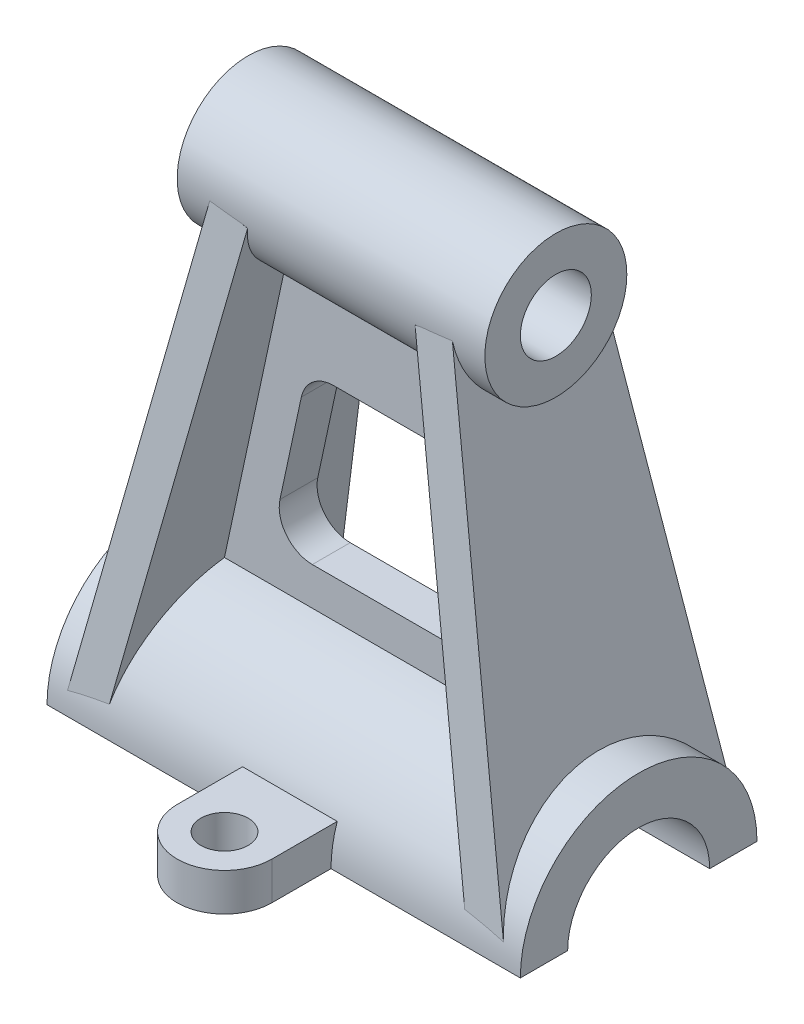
ISO-10303-21;
HEADER;
FILE_DESCRIPTION(('STEP AP214'),'2;1');
FILE_NAME('part.step','',(''),(''),'','','');
FILE_SCHEMA(('AUTOMOTIVE_DESIGN { 1 0 10303 214 1 1 1 1 }'));
ENDSEC;
DATA;
#1=APPLICATION_CONTEXT('core data for automotive mechanical design processes');
#2=APPLICATION_PROTOCOL_DEFINITION('international standard','automotive_design',2000,#1);
#3=PRODUCT_CONTEXT('',#1,'mechanical');
#4=PRODUCT('Part','Part','',(#3));
#5=PRODUCT_RELATED_PRODUCT_CATEGORY('part','',(#4));
#6=PRODUCT_DEFINITION_FORMATION('','',#4);
#7=PRODUCT_DEFINITION_CONTEXT('part definition',#1,'design');
#8=PRODUCT_DEFINITION('design','',#6,#7);
#9=PRODUCT_DEFINITION_SHAPE('','',#8);
#10=(LENGTH_UNIT() NAMED_UNIT(*) SI_UNIT(.MILLI.,.METRE.));
#11=(NAMED_UNIT(*) PLANE_ANGLE_UNIT() SI_UNIT($,.RADIAN.));
#12=(NAMED_UNIT(*) SI_UNIT($,.STERADIAN.) SOLID_ANGLE_UNIT());
#13=UNCERTAINTY_MEASURE_WITH_UNIT(LENGTH_MEASURE(1.E-05),#10,'distance_accuracy_value','');
#14=(GEOMETRIC_REPRESENTATION_CONTEXT(3) GLOBAL_UNCERTAINTY_ASSIGNED_CONTEXT((#13)) GLOBAL_UNIT_ASSIGNED_CONTEXT((#10,
#11,#12)) REPRESENTATION_CONTEXT('',''));
#15=CARTESIAN_POINT('',(0.,0.,0.));
#16=DIRECTION('',(0.,0.,1.));
#17=DIRECTION('',(1.,0.,0.));
#18=AXIS2_PLACEMENT_3D('',#15,#16,#17);
#19=CARTESIAN_POINT('',(50.,0.,25.));
#20=DIRECTION('',(0.,1.,0.));
#21=DIRECTION('',(0.,0.,1.));
#22=AXIS2_PLACEMENT_3D('',#19,#20,#21);
#23=PLANE('',#22);
#24=CARTESIAN_POINT('',(0.,0.,37.5));
#25=DIRECTION('',(0.,1.,0.));
#26=DIRECTION('',(0.,0.,1.));
#27=AXIS2_PLACEMENT_3D('',#24,#25,#26);
#28=CIRCLE('',#27,5.);
#29=CARTESIAN_POINT('',(0.,0.,42.5));
#30=VERTEX_POINT('',#29);
#31=EDGE_CURVE('E360',#30,#30,#28,.T.);
#32=ORIENTED_EDGE('',*,*,#31,.T.);
#33=EDGE_LOOP('',(#32));
#34=FACE_BOUND('',#33,.T.);
#35=DIRECTION('',(0.,0.,-1.));
#36=VECTOR('',#35,1.);
#37=CARTESIAN_POINT('',(-50.,0.,25.));
#38=LINE('',#37,#36);
#39=CARTESIAN_POINT('',(-50.,0.,25.));
#40=VERTEX_POINT('',#39);
#41=CARTESIAN_POINT('',(-50.,0.,15.));
#42=VERTEX_POINT('',#41);
#43=EDGE_CURVE('E261',#40,#42,#38,.T.);
#44=ORIENTED_EDGE('',*,*,#43,.T.);
#45=DIRECTION('',(1.,0.,0.));
#46=VECTOR('',#45,1.);
#47=CARTESIAN_POINT('',(-50.,0.,15.));
#48=LINE('',#47,#46);
#49=CARTESIAN_POINT('',(50.,0.,15.));
#50=VERTEX_POINT('',#49);
#51=EDGE_CURVE('E48',#42,#50,#48,.T.);
#52=ORIENTED_EDGE('',*,*,#51,.T.);
#53=DIRECTION('',(0.,0.,-1.));
#54=VECTOR('',#53,1.);
#55=CARTESIAN_POINT('',(50.,0.,25.));
#56=LINE('',#55,#54);
#57=CARTESIAN_POINT('',(50.,0.,25.));
#58=VERTEX_POINT('',#57);
#59=EDGE_CURVE('E271',#58,#50,#56,.T.);
#60=ORIENTED_EDGE('',*,*,#59,.F.);
#61=DIRECTION('',(-1.,0.,0.));
#62=VECTOR('',#61,1.);
#63=CARTESIAN_POINT('',(50.,0.,25.));
#64=LINE('',#63,#62);
#65=CARTESIAN_POINT('',(10.,0.,25.));
#66=VERTEX_POINT('',#65);
#67=EDGE_CURVE('E272',#58,#66,#64,.T.);
#68=ORIENTED_EDGE('',*,*,#67,.T.);
#69=DIRECTION('',(0.,0.,1.));
#70=VECTOR('',#69,1.);
#71=CARTESIAN_POINT('',(10.,0.,0.));
#72=LINE('',#71,#70);
#73=CARTESIAN_POINT('',(10.,0.,37.5));
#74=VERTEX_POINT('',#73);
#75=EDGE_CURVE('E354',#66,#74,#72,.T.);
#76=ORIENTED_EDGE('',*,*,#75,.T.);
#77=CARTESIAN_POINT('',(0.,0.,37.5));
#78=DIRECTION('',(0.,1.,0.));
#79=DIRECTION('',(0.,0.,1.));
#80=AXIS2_PLACEMENT_3D('',#77,#78,#79);
#81=CIRCLE('',#80,10.);
#82=CARTESIAN_POINT('',(-10.,0.,37.5));
#83=VERTEX_POINT('',#82);
#84=EDGE_CURVE('E11',#74,#83,#81,.F.);
#85=ORIENTED_EDGE('',*,*,#84,.T.);
#86=DIRECTION('',(0.,0.,-1.));
#87=VECTOR('',#86,1.);
#88=CARTESIAN_POINT('',(-10.,0.,0.));
#89=LINE('',#88,#87);
#90=CARTESIAN_POINT('',(-9.99999999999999,0.,25.));
#91=VERTEX_POINT('',#90);
#92=EDGE_CURVE('E351',#83,#91,#89,.T.);
#93=ORIENTED_EDGE('',*,*,#92,.T.);
#94=EDGE_CURVE('E270',#91,#40,#64,.T.);
#95=ORIENTED_EDGE('',*,*,#94,.T.);
#96=EDGE_LOOP('',(#44,#52,#60,#68,#76,#85,#93,#95));
#97=FACE_BOUND('',#96,.T.);
#98=ADVANCED_FACE('F32',(#34,#97),#23,.F.);
#99=CARTESIAN_POINT('',(0.,8.,37.5));
#100=DIRECTION('',(0.,-1.,0.));
#101=DIRECTION('',(0.,0.,-1.));
#102=AXIS2_PLACEMENT_3D('',#99,#100,#101);
#103=CYLINDRICAL_SURFACE('',#102,10.);
#104=DIRECTION('',(0.,-1.,0.));
#105=VECTOR('',#104,1.);
#106=CARTESIAN_POINT('',(10.,8.,37.5));
#107=LINE('',#106,#105);
#108=CARTESIAN_POINT('',(10.,8.,37.5));
#109=VERTEX_POINT('',#108);
#110=EDGE_CURVE('E333',#109,#74,#107,.T.);
#111=ORIENTED_EDGE('',*,*,#110,.F.);
#112=CARTESIAN_POINT('',(0.,8.,37.5));
#113=DIRECTION('',(0.,-1.,0.));
#114=DIRECTION('',(0.,0.,-1.));
#115=AXIS2_PLACEMENT_3D('',#112,#113,#114);
#116=CIRCLE('',#115,10.);
#117=CARTESIAN_POINT('',(-10.,8.,37.5));
#118=VERTEX_POINT('',#117);
#119=EDGE_CURVE('E41',#118,#109,#116,.F.);
#120=ORIENTED_EDGE('',*,*,#119,.F.);
#121=DIRECTION('',(0.,-1.,0.));
#122=VECTOR('',#121,1.);
#123=CARTESIAN_POINT('',(-10.,8.,37.5));
#124=LINE('',#123,#122);
#125=EDGE_CURVE('E336',#83,#118,#124,.F.);
#126=ORIENTED_EDGE('',*,*,#125,.F.);
#127=ORIENTED_EDGE('',*,*,#84,.F.);
#128=EDGE_LOOP('',(#111,#120,#126,#127));
#129=FACE_BOUND('',#128,.T.);
#130=ADVANCED_FACE('F34',(#129),#103,.T.);
#131=CARTESIAN_POINT('',(38.8161522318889,0.00482100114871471,24.8836299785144));
#132=DIRECTION('',(0.977659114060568,0.210196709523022,0.));
#133=DIRECTION('',(-0.210196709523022,0.977659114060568,0.));
#134=AXIS2_PLACEMENT_3D('',#131,#132,#133);
#135=PLANE('',#134);
#136=CARTESIAN_POINT('',(17.3171887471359,100.,0.));
#137=DIRECTION('',(0.977659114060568,0.210196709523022,0.));
#138=DIRECTION('',(-0.210196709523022,0.977659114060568,0.));
#139=AXIS2_PLACEMENT_3D('',#136,#137,#138);
#140=ELLIPSE('',#139,15.3427710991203,15.);
#141=CARTESIAN_POINT('',(20.425407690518,85.5431677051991,4.));
#142=VERTEX_POINT('',#141);
#143=CARTESIAN_POINT('',(17.6909319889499,98.2616593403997,14.8989318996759));
#144=VERTEX_POINT('',#143);
#145=EDGE_CURVE('E461',#142,#144,#140,.F.);
#146=ORIENTED_EDGE('',*,*,#145,.F.);
#147=DIRECTION('',(0.210196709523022,-0.977659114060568,0.));
#148=VECTOR('',#147,1.);
#149=CARTESIAN_POINT('',(22.2751769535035,76.939589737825,4.));
#150=LINE('',#149,#148);
#151=CARTESIAN_POINT('',(33.511434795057,24.6779253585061,3.99999999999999));
#152=VERTEX_POINT('',#151);
#153=EDGE_CURVE('E407',#142,#152,#150,.T.);
#154=ORIENTED_EDGE('',*,*,#153,.T.);
#155=CARTESIAN_POINT('',(38.8171887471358,0.,0.));
#156=DIRECTION('',(0.977659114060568,0.210196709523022,0.));
#157=DIRECTION('',(-0.210196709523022,0.977659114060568,0.));
#158=AXIS2_PLACEMENT_3D('',#155,#156,#157);
#159=ELLIPSE('',#158,25.5712851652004,25.);
#160=CARTESIAN_POINT('',(37.5375685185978,5.9517219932,24.2812068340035));
#161=VERTEX_POINT('',#160);
#162=EDGE_CURVE('E284',#152,#161,#159,.T.);
#163=ORIENTED_EDGE('',*,*,#162,.T.);
#164=DIRECTION('',(0.209173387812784,-0.972899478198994,0.0985550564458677));
#165=VECTOR('',#164,1.);
#166=CARTESIAN_POINT('',(38.8161522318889,0.00482100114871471,24.8836299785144));
#167=LINE('',#166,#165);
#168=CARTESIAN_POINT('',(17.6909319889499,98.2616593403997,14.9301779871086));
#169=VERTEX_POINT('',#168);
#170=EDGE_CURVE('E484',#169,#161,#167,.T.);
#171=ORIENTED_EDGE('',*,*,#170,.F.);
#172=DIRECTION('',(0.,0.,1.));
#173=VECTOR('',#172,1.);
#174=CARTESIAN_POINT('',(17.6909319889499,98.2616593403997,14.9301779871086));
#175=LINE('',#174,#173);
#176=EDGE_CURVE('E479',#144,#169,#175,.T.);
#177=ORIENTED_EDGE('',*,*,#176,.F.);
#178=EDGE_LOOP('',(#146,#154,#163,#171,#177));
#179=FACE_BOUND('',#178,.T.);
#180=ADVANCED_FACE('F537',(#179),#135,.F.);
#181=CARTESIAN_POINT('',(-38.8161522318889,0.00482100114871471,24.8836299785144));
#182=DIRECTION('',(-0.977659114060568,0.210196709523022,0.));
#183=DIRECTION('',(0.210196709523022,0.977659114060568,0.));
#184=AXIS2_PLACEMENT_3D('',#181,#182,#183);
#185=PLANE('',#184);
#186=CARTESIAN_POINT('',(-38.8171887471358,0.,0.));
#187=DIRECTION('',(-0.977659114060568,0.210196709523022,0.));
#188=DIRECTION('',(-0.210196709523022,-0.977659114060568,0.));
#189=AXIS2_PLACEMENT_3D('',#186,#187,#188);
#190=ELLIPSE('',#189,25.5712851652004,25.);
#191=CARTESIAN_POINT('',(-37.5375685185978,5.9517219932,24.2812068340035));
#192=VERTEX_POINT('',#191);
#193=CARTESIAN_POINT('',(-33.511434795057,24.6779253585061,3.99999999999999));
#194=VERTEX_POINT('',#193);
#195=EDGE_CURVE('E449',#192,#194,#190,.T.);
#196=ORIENTED_EDGE('',*,*,#195,.T.);
#197=DIRECTION('',(0.210196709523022,0.977659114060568,0.));
#198=VECTOR('',#197,1.);
#199=CARTESIAN_POINT('',(-38.8161522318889,0.00482100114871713,3.99999999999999));
#200=LINE('',#199,#198);
#201=CARTESIAN_POINT('',(-20.4254076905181,85.5431677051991,4.));
#202=VERTEX_POINT('',#201);
#203=EDGE_CURVE('E310',#194,#202,#200,.T.);
#204=ORIENTED_EDGE('',*,*,#203,.T.);
#205=CARTESIAN_POINT('',(-17.3171887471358,100.,0.));
#206=DIRECTION('',(-0.977659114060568,0.210196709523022,0.));
#207=DIRECTION('',(-0.210196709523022,-0.977659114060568,0.));
#208=AXIS2_PLACEMENT_3D('',#205,#206,#207);
#209=ELLIPSE('',#208,15.3427710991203,15.);
#210=CARTESIAN_POINT('',(-17.6909319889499,98.2616593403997,14.8989318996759));
#211=VERTEX_POINT('',#210);
#212=EDGE_CURVE('E303',#202,#211,#209,.T.);
#213=ORIENTED_EDGE('',*,*,#212,.T.);
#214=DIRECTION('',(0.,0.,1.));
#215=VECTOR('',#214,1.);
#216=CARTESIAN_POINT('',(-17.6909319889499,98.2616593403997,14.9301779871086));
#217=LINE('',#216,#215);
#218=CARTESIAN_POINT('',(-17.6909319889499,98.2616593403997,14.9301779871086));
#219=VERTEX_POINT('',#218);
#220=EDGE_CURVE('E428',#211,#219,#217,.T.);
#221=ORIENTED_EDGE('',*,*,#220,.T.);
#222=DIRECTION('',(-0.209173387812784,-0.972899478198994,0.0985550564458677));
#223=VECTOR('',#222,1.);
#224=CARTESIAN_POINT('',(-38.8161522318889,0.00482100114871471,24.8836299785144));
#225=LINE('',#224,#223);
#226=EDGE_CURVE('E425',#219,#192,#225,.T.);
#227=ORIENTED_EDGE('',*,*,#226,.T.);
#228=EDGE_LOOP('',(#196,#204,#213,#221,#227));
#229=FACE_BOUND('',#228,.T.);
#230=ADVANCED_FACE('F615',(#229),#185,.F.);
#231=CARTESIAN_POINT('',(50.,0.,0.));
#232=DIRECTION('',(-1.,0.,0.));
#233=DIRECTION('',(0.,0.,1.));
#234=AXIS2_PLACEMENT_3D('',#231,#232,#233);
#235=CYLINDRICAL_SURFACE('',#234,25.);
#236=ORIENTED_EDGE('',*,*,#94,.F.);
#237=CARTESIAN_POINT('',(-10.,0.,0.));
#238=DIRECTION('',(-1.,0.,0.));
#239=DIRECTION('',(0.,0.,1.));
#240=AXIS2_PLACEMENT_3D('',#237,#238,#239);
#241=CIRCLE('',#240,25.);
#242=CARTESIAN_POINT('',(-10.,8.,23.685438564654));
#243=VERTEX_POINT('',#242);
#244=EDGE_CURVE('E363',#91,#243,#241,.T.);
#245=ORIENTED_EDGE('',*,*,#244,.T.);
#246=DIRECTION('',(-1.,0.,0.));
#247=VECTOR('',#246,1.);
#248=CARTESIAN_POINT('',(50.,8.,23.685438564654));
#249=LINE('',#248,#247);
#250=CARTESIAN_POINT('',(10.,8.,23.685438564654));
#251=VERTEX_POINT('',#250);
#252=EDGE_CURVE('E330',#251,#243,#249,.T.);
#253=ORIENTED_EDGE('',*,*,#252,.F.);
#254=CARTESIAN_POINT('',(10.,0.,0.));
#255=DIRECTION('',(1.,0.,0.));
#256=DIRECTION('',(0.,0.,-1.));
#257=AXIS2_PLACEMENT_3D('',#254,#255,#256);
#258=CIRCLE('',#257,25.);
#259=EDGE_CURVE('E350',#251,#66,#258,.T.);
#260=ORIENTED_EDGE('',*,*,#259,.T.);
#261=ORIENTED_EDGE('',*,*,#67,.F.);
#262=CARTESIAN_POINT('',(50.,0.,0.));
#263=DIRECTION('',(1.,0.,0.));
#264=DIRECTION('',(0.,0.,-1.));
#265=AXIS2_PLACEMENT_3D('',#262,#263,#264);
#266=CIRCLE('',#265,25.);
#267=CARTESIAN_POINT('',(50.,0.,-25.));
#268=VERTEX_POINT('',#267);
#269=EDGE_CURVE('E263',#268,#58,#266,.T.);
#270=ORIENTED_EDGE('',*,*,#269,.F.);
#271=DIRECTION('',(-1.,0.,0.));
#272=VECTOR('',#271,1.);
#273=CARTESIAN_POINT('',(50.,0.,-25.));
#274=LINE('',#273,#272);
#275=CARTESIAN_POINT('',(-50.,0.,-25.));
#276=VERTEX_POINT('',#275);
#277=EDGE_CURVE('E268',#268,#276,#274,.T.);
#278=ORIENTED_EDGE('',*,*,#277,.T.);
#279=CARTESIAN_POINT('',(-50.,0.,0.));
#280=DIRECTION('',(1.,0.,0.));
#281=DIRECTION('',(0.,0.,-1.));
#282=AXIS2_PLACEMENT_3D('',#279,#280,#281);
#283=CIRCLE('',#282,25.);
#284=EDGE_CURVE('E260',#276,#40,#283,.T.);
#285=ORIENTED_EDGE('',*,*,#284,.T.);
#286=EDGE_LOOP('',(#236,#245,#253,#260,#261,#270,#278,#285));
#287=FACE_BOUND('',#286,.T.);
#288=ORIENTED_EDGE('',*,*,#162,.F.);
#289=DIRECTION('',(-1.,0.,0.));
#290=VECTOR('',#289,1.);
#291=CARTESIAN_POINT('',(50.,24.6779253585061,3.99999999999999));
#292=LINE('',#291,#290);
#293=EDGE_CURVE('E421',#152,#194,#292,.T.);
#294=ORIENTED_EDGE('',*,*,#293,.T.);
#295=ORIENTED_EDGE('',*,*,#195,.F.);
#296=CARTESIAN_POINT('',(1156.54069767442,0.,0.));
#297=DIRECTION('',(-0.0207159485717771,-0.0963532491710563,-0.995131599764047));
#298=DIRECTION('',(-0.999785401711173,0.00199647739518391,0.0206195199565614));
#299=AXIS2_PLACEMENT_3D('',#296,#297,#298);
#300=ELLIPSE('',#299,1206.79967481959,25.);
#301=CARTESIAN_POINT('',(-46.0511983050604,4.41303113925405,24.6074207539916));
#302=VERTEX_POINT('',#301);
#303=EDGE_CURVE('E452',#302,#192,#300,.T.);
#304=ORIENTED_EDGE('',*,*,#303,.F.);
#305=CARTESIAN_POINT('',(-47.,0.,0.));
#306=DIRECTION('',(-0.977659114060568,0.210196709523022,0.));
#307=DIRECTION('',(-0.210196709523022,-0.977659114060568,0.));
#308=AXIS2_PLACEMENT_3D('',#305,#306,#307);
#309=ELLIPSE('',#308,25.5712851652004,25.);
#310=CARTESIAN_POINT('',(-46.0511983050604,4.41303113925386,-24.6074207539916));
#311=VERTEX_POINT('',#310);
#312=EDGE_CURVE('E443',#302,#311,#309,.T.);
#313=ORIENTED_EDGE('',*,*,#312,.T.);
#314=CARTESIAN_POINT('',(1156.54069767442,0.,0.));
#315=DIRECTION('',(-0.0207159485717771,-0.0963532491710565,0.995131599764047));
#316=DIRECTION('',(-0.999785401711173,0.00199647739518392,-0.0206195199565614));
#317=AXIS2_PLACEMENT_3D('',#314,#315,#316);
#318=ELLIPSE('',#317,1206.79967481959,25.);
#319=CARTESIAN_POINT('',(-37.5375685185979,5.95172199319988,-24.2812068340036));
#320=VERTEX_POINT('',#319);
#321=EDGE_CURVE('E454',#320,#311,#318,.T.);
#322=ORIENTED_EDGE('',*,*,#321,.F.);
#323=CARTESIAN_POINT('',(-33.511434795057,24.6779253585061,-3.99999999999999));
#324=VERTEX_POINT('',#323);
#325=EDGE_CURVE('E448',#324,#320,#190,.T.);
#326=ORIENTED_EDGE('',*,*,#325,.F.);
#327=DIRECTION('',(-1.,0.,0.));
#328=VECTOR('',#327,1.);
#329=CARTESIAN_POINT('',(50.,24.6779253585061,-3.99999999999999));
#330=LINE('',#329,#328);
#331=CARTESIAN_POINT('',(33.511434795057,24.6779253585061,-3.99999999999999));
#332=VERTEX_POINT('',#331);
#333=EDGE_CURVE('E415',#324,#332,#330,.F.);
#334=ORIENTED_EDGE('',*,*,#333,.T.);
#335=CARTESIAN_POINT('',(37.5375685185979,5.95172199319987,-24.2812068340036));
#336=VERTEX_POINT('',#335);
#337=EDGE_CURVE('E285',#336,#332,#159,.T.);
#338=ORIENTED_EDGE('',*,*,#337,.F.);
#339=CARTESIAN_POINT('',(-1156.54069767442,0.,0.));
#340=DIRECTION('',(-0.0207159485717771,0.0963532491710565,-0.995131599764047));
#341=DIRECTION('',(-0.999785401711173,-0.00199647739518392,0.0206195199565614));
#342=AXIS2_PLACEMENT_3D('',#339,#340,#341);
#343=ELLIPSE('',#342,1206.79967481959,25.);
#344=CARTESIAN_POINT('',(46.0511983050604,4.41303113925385,-24.6074207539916));
#345=VERTEX_POINT('',#344);
#346=EDGE_CURVE('E278',#336,#345,#343,.T.);
#347=ORIENTED_EDGE('',*,*,#346,.T.);
#348=CARTESIAN_POINT('',(47.,0.,0.));
#349=DIRECTION('',(0.977659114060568,0.210196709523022,0.));
#350=DIRECTION('',(-0.210196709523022,0.977659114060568,0.));
#351=AXIS2_PLACEMENT_3D('',#348,#349,#350);
#352=ELLIPSE('',#351,25.5712851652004,25.);
#353=CARTESIAN_POINT('',(46.0511983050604,4.41303113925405,24.6074207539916));
#354=VERTEX_POINT('',#353);
#355=EDGE_CURVE('E275',#345,#354,#352,.T.);
#356=ORIENTED_EDGE('',*,*,#355,.T.);
#357=CARTESIAN_POINT('',(-1156.54069767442,0.,0.));
#358=DIRECTION('',(-0.0207159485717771,0.0963532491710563,0.995131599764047));
#359=DIRECTION('',(-0.999785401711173,-0.00199647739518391,-0.0206195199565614));
#360=AXIS2_PLACEMENT_3D('',#357,#358,#359);
#361=ELLIPSE('',#360,1206.79967481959,25.);
#362=EDGE_CURVE('E281',#354,#161,#361,.T.);
#363=ORIENTED_EDGE('',*,*,#362,.T.);
#364=EDGE_LOOP('',(#288,#294,#295,#304,#313,#322,#326,#334,#338,#347,#356,#363));
#365=FACE_BOUND('',#364,.T.);
#366=ADVANCED_FACE('F503',(#287,#365),#235,.T.);
#367=CARTESIAN_POINT('',(32.5,100.,0.));
#368=DIRECTION('',(-1.,0.,0.));
#369=DIRECTION('',(0.,0.,1.));
#370=AXIS2_PLACEMENT_3D('',#367,#368,#369);
#371=CYLINDRICAL_SURFACE('',#370,15.);
#372=CARTESIAN_POINT('',(-32.5,100.,0.));
#373=DIRECTION('',(1.,0.,0.));
#374=DIRECTION('',(0.,0.,-1.));
#375=AXIS2_PLACEMENT_3D('',#372,#373,#374);
#376=CIRCLE('',#375,15.);
#377=CARTESIAN_POINT('',(-32.5,100.,-15.));
#378=VERTEX_POINT('',#377);
#379=EDGE_CURVE('E457',#378,#378,#376,.T.);
#380=ORIENTED_EDGE('',*,*,#379,.T.);
#381=EDGE_LOOP('',(#380));
#382=FACE_BOUND('',#381,.T.);
#383=CARTESIAN_POINT('',(32.5,100.,0.));
#384=DIRECTION('',(1.,0.,0.));
#385=DIRECTION('',(0.,0.,-1.));
#386=AXIS2_PLACEMENT_3D('',#383,#384,#385);
#387=CIRCLE('',#386,15.);
#388=CARTESIAN_POINT('',(32.5,100.,-15.));
#389=VERTEX_POINT('',#388);
#390=EDGE_CURVE('E458',#389,#389,#387,.T.);
#391=ORIENTED_EDGE('',*,*,#390,.F.);
#392=EDGE_LOOP('',(#391));
#393=FACE_BOUND('',#392,.T.);
#394=ORIENTED_EDGE('',*,*,#212,.F.);
#395=DIRECTION('',(-1.,0.,0.));
#396=VECTOR('',#395,1.);
#397=CARTESIAN_POINT('',(32.5,85.543167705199,4.));
#398=LINE('',#397,#396);
#399=EDGE_CURVE('E418',#202,#142,#398,.F.);
#400=ORIENTED_EDGE('',*,*,#399,.T.);
#401=ORIENTED_EDGE('',*,*,#145,.T.);
#402=CARTESIAN_POINT('',(25.7762373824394,100.,0.));
#403=DIRECTION('',(-0.210196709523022,0.977659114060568,0.));
#404=DIRECTION('',(-0.977659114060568,-0.210196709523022,0.));
#405=AXIS2_PLACEMENT_3D('',#402,#403,#404);
#406=ELLIPSE('',#405,71.3617260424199,15.);
#407=CARTESIAN_POINT('',(19.0524747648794,98.5543910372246,14.9301779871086));
#408=VERTEX_POINT('',#407);
#409=EDGE_CURVE('E288',#408,#144,#406,.F.);
#410=ORIENTED_EDGE('',*,*,#409,.F.);
#411=CARTESIAN_POINT('',(-691.424418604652,100.,0.));
#412=DIRECTION('',(-0.0207159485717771,0.0963532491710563,0.995131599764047));
#413=DIRECTION('',(-0.999785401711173,-0.00199647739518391,-0.0206195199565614));
#414=AXIS2_PLACEMENT_3D('',#411,#412,#413);
#415=ELLIPSE('',#414,724.079804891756,15.);
#416=CARTESIAN_POINT('',(25.633220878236,99.3803680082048,14.9871964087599));
#417=VERTEX_POINT('',#416);
#418=EDGE_CURVE('E467',#417,#408,#415,.F.);
#419=ORIENTED_EDGE('',*,*,#418,.F.);
#420=CARTESIAN_POINT('',(25.5,100.,0.));
#421=DIRECTION('',(0.977659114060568,0.210196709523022,0.));
#422=DIRECTION('',(-0.210196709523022,0.977659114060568,0.));
#423=AXIS2_PLACEMENT_3D('',#420,#421,#422);
#424=ELLIPSE('',#423,15.3427710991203,15.);
#425=CARTESIAN_POINT('',(25.6332208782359,99.3803680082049,-14.9871964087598));
#426=VERTEX_POINT('',#425);
#427=EDGE_CURVE('E470',#426,#417,#424,.F.);
#428=ORIENTED_EDGE('',*,*,#427,.F.);
#429=CARTESIAN_POINT('',(-691.42441860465,100.,0.));
#430=DIRECTION('',(-0.0207159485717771,0.0963532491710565,-0.995131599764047));
#431=DIRECTION('',(-0.999785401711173,-0.00199647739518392,0.0206195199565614));
#432=AXIS2_PLACEMENT_3D('',#429,#430,#431);
#433=ELLIPSE('',#432,724.079804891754,15.);
#434=CARTESIAN_POINT('',(19.0524747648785,98.5543910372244,-14.9301779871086));
#435=VERTEX_POINT('',#434);
#436=EDGE_CURVE('E473',#435,#426,#433,.F.);
#437=ORIENTED_EDGE('',*,*,#436,.F.);
#438=CARTESIAN_POINT('',(17.6909319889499,98.2616593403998,-14.8989318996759));
#439=VERTEX_POINT('',#438);
#440=EDGE_CURVE('E291',#439,#435,#406,.F.);
#441=ORIENTED_EDGE('',*,*,#440,.F.);
#442=CARTESIAN_POINT('',(20.425407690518,85.5431677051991,-4.));
#443=VERTEX_POINT('',#442);
#444=EDGE_CURVE('E464',#439,#443,#140,.F.);
#445=ORIENTED_EDGE('',*,*,#444,.T.);
#446=DIRECTION('',(-1.,0.,0.));
#447=VECTOR('',#446,1.);
#448=CARTESIAN_POINT('',(32.5,85.543167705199,-4.));
#449=LINE('',#448,#447);
#450=CARTESIAN_POINT('',(-20.425407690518,85.5431677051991,-4.));
#451=VERTEX_POINT('',#450);
#452=EDGE_CURVE('E410',#443,#451,#449,.T.);
#453=ORIENTED_EDGE('',*,*,#452,.T.);
#454=CARTESIAN_POINT('',(-17.6909319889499,98.2616593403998,-14.8989318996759));
#455=VERTEX_POINT('',#454);
#456=EDGE_CURVE('E304',#455,#451,#209,.T.);
#457=ORIENTED_EDGE('',*,*,#456,.F.);
#458=CARTESIAN_POINT('',(-25.7762373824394,100.,0.));
#459=DIRECTION('',(-0.210196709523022,-0.977659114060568,0.));
#460=DIRECTION('',(-0.977659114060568,0.210196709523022,0.));
#461=AXIS2_PLACEMENT_3D('',#458,#459,#460);
#462=ELLIPSE('',#461,71.3617260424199,15.);
#463=CARTESIAN_POINT('',(-19.0524747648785,98.5543910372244,-14.9301779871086));
#464=VERTEX_POINT('',#463);
#465=EDGE_CURVE('E301',#464,#455,#462,.T.);
#466=ORIENTED_EDGE('',*,*,#465,.F.);
#467=CARTESIAN_POINT('',(691.42441860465,100.,0.));
#468=DIRECTION('',(-0.0207159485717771,-0.0963532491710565,0.995131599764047));
#469=DIRECTION('',(-0.999785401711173,0.00199647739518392,-0.0206195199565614));
#470=AXIS2_PLACEMENT_3D('',#467,#468,#469);
#471=ELLIPSE('',#470,724.079804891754,15.);
#472=CARTESIAN_POINT('',(-25.6332208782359,99.3803680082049,-14.9871964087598));
#473=VERTEX_POINT('',#472);
#474=EDGE_CURVE('E300',#473,#464,#471,.T.);
#475=ORIENTED_EDGE('',*,*,#474,.F.);
#476=CARTESIAN_POINT('',(-25.5,100.,0.));
#477=DIRECTION('',(-0.977659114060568,0.210196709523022,0.));
#478=DIRECTION('',(-0.210196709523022,-0.977659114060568,0.));
#479=AXIS2_PLACEMENT_3D('',#476,#477,#478);
#480=ELLIPSE('',#479,15.3427710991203,15.);
#481=CARTESIAN_POINT('',(-25.6332208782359,99.3803680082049,14.9871964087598));
#482=VERTEX_POINT('',#481);
#483=EDGE_CURVE('E292',#473,#482,#480,.T.);
#484=ORIENTED_EDGE('',*,*,#483,.T.);
#485=CARTESIAN_POINT('',(691.424418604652,100.,0.));
#486=DIRECTION('',(-0.0207159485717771,-0.0963532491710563,-0.995131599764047));
#487=DIRECTION('',(-0.999785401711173,0.00199647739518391,0.0206195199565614));
#488=AXIS2_PLACEMENT_3D('',#485,#486,#487);
#489=ELLIPSE('',#488,724.079804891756,15.);
#490=CARTESIAN_POINT('',(-19.0524747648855,98.5543910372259,14.9301779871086));
#491=VERTEX_POINT('',#490);
#492=EDGE_CURVE('E295',#491,#482,#489,.T.);
#493=ORIENTED_EDGE('',*,*,#492,.F.);
#494=EDGE_CURVE('E298',#211,#491,#462,.T.);
#495=ORIENTED_EDGE('',*,*,#494,.F.);
#496=EDGE_LOOP('',(#394,#400,#401,#410,#419,#428,#437,#441,#445,#453,#457,#466,#475,#484,#493,#495));
#497=FACE_BOUND('',#496,.T.);
#498=ADVANCED_FACE('F582',(#382,#393,#497),#371,.T.);
#499=CARTESIAN_POINT('',(38.8161522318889,0.00482100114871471,24.8836299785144));
#500=DIRECTION('',(-0.0207159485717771,0.0963532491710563,0.995131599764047));
#501=DIRECTION('',(0.,-0.995345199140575,0.0963739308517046));
#502=AXIS2_PLACEMENT_3D('',#499,#500,#501);
#503=PLANE('',#502);
#504=DIRECTION('',(0.209173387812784,-0.972899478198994,0.0985550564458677));
#505=VECTOR('',#504,1.);
#506=CARTESIAN_POINT('',(46.6374251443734,1.68639467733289,24.8836299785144));
#507=LINE('',#506,#505);
#508=EDGE_CURVE('E480',#417,#354,#507,.T.);
#509=ORIENTED_EDGE('',*,*,#508,.F.);
#510=ORIENTED_EDGE('',*,*,#418,.T.);
#511=DIRECTION('',(0.977659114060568,0.210196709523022,0.));
#512=VECTOR('',#511,1.);
#513=CARTESIAN_POINT('',(17.6909319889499,98.2616593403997,14.9301779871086));
#514=LINE('',#513,#512);
#515=EDGE_CURVE('E264',#169,#408,#514,.T.);
#516=ORIENTED_EDGE('',*,*,#515,.F.);
#517=ORIENTED_EDGE('',*,*,#170,.T.);
#518=ORIENTED_EDGE('',*,*,#362,.F.);
#519=EDGE_LOOP('',(#509,#510,#516,#517,#518));
#520=FACE_BOUND('',#519,.T.);
#521=ADVANCED_FACE('F556',(#520),#503,.T.);
#522=CARTESIAN_POINT('',(38.8161522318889,0.00482100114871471,-24.8836299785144));
#523=DIRECTION('',(-0.0207159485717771,0.0963532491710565,-0.995131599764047));
#524=DIRECTION('',(0.,0.995345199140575,0.0963739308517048));
#525=AXIS2_PLACEMENT_3D('',#522,#523,#524);
#526=PLANE('',#525);
#527=DIRECTION('',(0.977659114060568,0.210196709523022,0.));
#528=VECTOR('',#527,1.);
#529=CARTESIAN_POINT('',(17.6909319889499,98.2616593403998,-14.9301779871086));
#530=LINE('',#529,#528);
#531=CARTESIAN_POINT('',(17.6909319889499,98.2616593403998,-14.9301779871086));
#532=VERTEX_POINT('',#531);
#533=EDGE_CURVE('E487',#532,#435,#530,.T.);
#534=ORIENTED_EDGE('',*,*,#533,.T.);
#535=ORIENTED_EDGE('',*,*,#436,.T.);
#536=DIRECTION('',(-0.209173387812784,0.972899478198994,0.0985550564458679));
#537=VECTOR('',#536,1.);
#538=CARTESIAN_POINT('',(46.6374251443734,1.68639467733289,-24.8836299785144));
#539=LINE('',#538,#537);
#540=EDGE_CURVE('E476',#345,#426,#539,.T.);
#541=ORIENTED_EDGE('',*,*,#540,.F.);
#542=ORIENTED_EDGE('',*,*,#346,.F.);
#543=DIRECTION('',(-0.209173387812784,0.972899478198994,0.0985550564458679));
#544=VECTOR('',#543,1.);
#545=CARTESIAN_POINT('',(38.8161522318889,0.00482100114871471,-24.8836299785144));
#546=LINE('',#545,#544);
#547=EDGE_CURVE('E477',#336,#532,#546,.T.);
#548=ORIENTED_EDGE('',*,*,#547,.T.);
#549=EDGE_LOOP('',(#534,#535,#541,#542,#548));
#550=FACE_BOUND('',#549,.T.);
#551=ADVANCED_FACE('F558',(#550),#526,.T.);
#552=ORIENTED_EDGE('',*,*,#337,.T.);
#553=DIRECTION('',(-0.210196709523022,0.977659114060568,0.));
#554=VECTOR('',#553,1.);
#555=CARTESIAN_POINT('',(22.2751769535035,76.939589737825,-4.));
#556=LINE('',#555,#554);
#557=EDGE_CURVE('E406',#332,#443,#556,.T.);
#558=ORIENTED_EDGE('',*,*,#557,.T.);
#559=ORIENTED_EDGE('',*,*,#444,.F.);
#560=EDGE_CURVE('E481',#532,#439,#175,.T.);
#561=ORIENTED_EDGE('',*,*,#560,.F.);
#562=ORIENTED_EDGE('',*,*,#547,.F.);
#563=EDGE_LOOP('',(#552,#558,#559,#561,#562));
#564=FACE_BOUND('',#563,.T.);
#565=ADVANCED_FACE('F560',(#564),#135,.F.);
#566=CARTESIAN_POINT('',(46.6374251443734,1.68639467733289,24.8836299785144));
#567=DIRECTION('',(0.977659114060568,0.210196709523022,0.));
#568=DIRECTION('',(-0.210196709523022,0.977659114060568,0.));
#569=AXIS2_PLACEMENT_3D('',#566,#567,#568);
#570=PLANE('',#569);
#571=ORIENTED_EDGE('',*,*,#540,.T.);
#572=ORIENTED_EDGE('',*,*,#427,.T.);
#573=ORIENTED_EDGE('',*,*,#508,.T.);
#574=ORIENTED_EDGE('',*,*,#355,.F.);
#575=EDGE_LOOP('',(#571,#572,#573,#574));
#576=FACE_BOUND('',#575,.T.);
#577=ADVANCED_FACE('F552',(#576),#570,.T.);
#578=CARTESIAN_POINT('',(17.6909319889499,98.2616593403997,14.9301779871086));
#579=DIRECTION('',(-0.210196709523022,0.977659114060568,0.));
#580=DIRECTION('',(-0.977659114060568,-0.210196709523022,0.));
#581=AXIS2_PLACEMENT_3D('',#578,#579,#580);
#582=PLANE('',#581);
#583=ORIENTED_EDGE('',*,*,#560,.T.);
#584=ORIENTED_EDGE('',*,*,#440,.T.);
#585=ORIENTED_EDGE('',*,*,#533,.F.);
#586=EDGE_LOOP('',(#583,#584,#585));
#587=FACE_BOUND('',#586,.T.);
#588=ADVANCED_FACE('F546',(#587),#582,.T.);
#589=ORIENTED_EDGE('',*,*,#515,.T.);
#590=ORIENTED_EDGE('',*,*,#409,.T.);
#591=ORIENTED_EDGE('',*,*,#176,.T.);
#592=EDGE_LOOP('',(#589,#590,#591));
#593=FACE_BOUND('',#592,.T.);
#594=ADVANCED_FACE('F540',(#593),#582,.T.);
#595=CARTESIAN_POINT('',(50.,0.,-15.));
#596=VERTEX_POINT('',#595);
#597=EDGE_CURVE('E255',#596,#268,#56,.T.);
#598=ORIENTED_EDGE('',*,*,#597,.F.);
#599=DIRECTION('',(1.,0.,0.));
#600=VECTOR('',#599,1.);
#601=CARTESIAN_POINT('',(-50.,0.,-15.));
#602=LINE('',#601,#600);
#603=CARTESIAN_POINT('',(-50.,0.,-15.));
#604=VERTEX_POINT('',#603);
#605=EDGE_CURVE('E241',#596,#604,#602,.F.);
#606=ORIENTED_EDGE('',*,*,#605,.T.);
#607=EDGE_CURVE('E253',#604,#276,#38,.T.);
#608=ORIENTED_EDGE('',*,*,#607,.T.);
#609=ORIENTED_EDGE('',*,*,#277,.F.);
#610=EDGE_LOOP('',(#598,#606,#608,#609));
#611=FACE_BOUND('',#610,.T.);
#612=ADVANCED_FACE('F251',(#611),#23,.F.);
#613=CARTESIAN_POINT('',(50.,0.,0.));
#614=DIRECTION('',(1.,0.,0.));
#615=DIRECTION('',(0.,0.,-1.));
#616=AXIS2_PLACEMENT_3D('',#613,#614,#615);
#617=PLANE('',#616);
#618=CARTESIAN_POINT('',(50.,0.,0.));
#619=DIRECTION('',(1.,0.,0.));
#620=DIRECTION('',(0.,0.,-1.));
#621=AXIS2_PLACEMENT_3D('',#618,#619,#620);
#622=CIRCLE('',#621,15.);
#623=EDGE_CURVE('E247',#596,#50,#622,.T.);
#624=ORIENTED_EDGE('',*,*,#623,.F.);
#625=ORIENTED_EDGE('',*,*,#597,.T.);
#626=ORIENTED_EDGE('',*,*,#269,.T.);
#627=ORIENTED_EDGE('',*,*,#59,.T.);
#628=EDGE_LOOP('',(#624,#625,#626,#627));
#629=FACE_BOUND('',#628,.T.);
#630=ADVANCED_FACE('F498',(#629),#617,.T.);
#631=CARTESIAN_POINT('',(-50.,0.,0.));
#632=DIRECTION('',(1.,0.,0.));
#633=DIRECTION('',(0.,0.,-1.));
#634=AXIS2_PLACEMENT_3D('',#631,#632,#633);
#635=PLANE('',#634);
#636=ORIENTED_EDGE('',*,*,#607,.F.);
#637=CARTESIAN_POINT('',(-50.,0.,0.));
#638=DIRECTION('',(1.,0.,0.));
#639=DIRECTION('',(0.,0.,-1.));
#640=AXIS2_PLACEMENT_3D('',#637,#638,#639);
#641=CIRCLE('',#640,15.);
#642=EDGE_CURVE('E238',#604,#42,#641,.T.);
#643=ORIENTED_EDGE('',*,*,#642,.T.);
#644=ORIENTED_EDGE('',*,*,#43,.F.);
#645=ORIENTED_EDGE('',*,*,#284,.F.);
#646=EDGE_LOOP('',(#636,#643,#644,#645));
#647=FACE_BOUND('',#646,.T.);
#648=ADVANCED_FACE('F258',(#647),#635,.F.);
#649=CARTESIAN_POINT('',(32.5,100.,0.));
#650=DIRECTION('',(1.,0.,0.));
#651=DIRECTION('',(0.,0.,-1.));
#652=AXIS2_PLACEMENT_3D('',#649,#650,#651);
#653=PLANE('',#652);
#654=CARTESIAN_POINT('',(32.4999999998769,100.,0.));
#655=DIRECTION('',(1.,0.,0.));
#656=DIRECTION('',(0.,0.,-1.));
#657=AXIS2_PLACEMENT_3D('',#654,#655,#656);
#658=CIRCLE('',#657,7.5);
#659=CARTESIAN_POINT('',(32.4999999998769,100.,-7.5));
#660=VERTEX_POINT('',#659);
#661=EDGE_CURVE('E922',#660,#660,#658,.T.);
#662=ORIENTED_EDGE('',*,*,#661,.F.);
#663=EDGE_LOOP('',(#662));
#664=FACE_BOUND('',#663,.T.);
#665=ORIENTED_EDGE('',*,*,#390,.T.);
#666=EDGE_LOOP('',(#665));
#667=FACE_BOUND('',#666,.T.);
#668=ADVANCED_FACE('F563',(#664,#667),#653,.T.);
#669=CARTESIAN_POINT('',(-32.5,100.,0.));
#670=DIRECTION('',(1.,0.,0.));
#671=DIRECTION('',(0.,0.,-1.));
#672=AXIS2_PLACEMENT_3D('',#669,#670,#671);
#673=PLANE('',#672);
#674=CARTESIAN_POINT('',(-32.5,100.,0.));
#675=DIRECTION('',(1.,0.,0.));
#676=DIRECTION('',(0.,0.,-1.));
#677=AXIS2_PLACEMENT_3D('',#674,#675,#676);
#678=CIRCLE('',#677,7.5);
#679=CARTESIAN_POINT('',(-32.5,100.,-7.5));
#680=VERTEX_POINT('',#679);
#681=EDGE_CURVE('E36',#680,#680,#678,.T.);
#682=ORIENTED_EDGE('',*,*,#681,.T.);
#683=EDGE_LOOP('',(#682));
#684=FACE_BOUND('',#683,.T.);
#685=ORIENTED_EDGE('',*,*,#379,.F.);
#686=EDGE_LOOP('',(#685));
#687=FACE_BOUND('',#686,.T.);
#688=ADVANCED_FACE('F567',(#684,#687),#673,.F.);
#689=CARTESIAN_POINT('',(-38.8161522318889,0.00482100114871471,-24.8836299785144));
#690=DIRECTION('',(-0.0207159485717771,-0.0963532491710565,0.995131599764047));
#691=DIRECTION('',(0.,-0.995345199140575,-0.0963739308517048));
#692=AXIS2_PLACEMENT_3D('',#689,#690,#691);
#693=PLANE('',#692);
#694=DIRECTION('',(0.209173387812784,0.972899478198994,0.0985550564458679));
#695=VECTOR('',#694,1.);
#696=CARTESIAN_POINT('',(-38.8161522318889,0.00482100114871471,-24.8836299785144));
#697=LINE('',#696,#695);
#698=CARTESIAN_POINT('',(-17.6909319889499,98.2616593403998,-14.9301779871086));
#699=VERTEX_POINT('',#698);
#700=EDGE_CURVE('E433',#320,#699,#697,.T.);
#701=ORIENTED_EDGE('',*,*,#700,.F.);
#702=ORIENTED_EDGE('',*,*,#321,.T.);
#703=DIRECTION('',(0.209173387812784,0.972899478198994,0.0985550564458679));
#704=VECTOR('',#703,1.);
#705=CARTESIAN_POINT('',(-46.6374251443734,1.68639467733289,-24.8836299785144));
#706=LINE('',#705,#704);
#707=EDGE_CURVE('E429',#311,#473,#706,.T.);
#708=ORIENTED_EDGE('',*,*,#707,.T.);
#709=ORIENTED_EDGE('',*,*,#474,.T.);
#710=DIRECTION('',(-0.977659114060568,0.210196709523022,0.));
#711=VECTOR('',#710,1.);
#712=CARTESIAN_POINT('',(-17.6909319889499,98.2616593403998,-14.9301779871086));
#713=LINE('',#712,#711);
#714=EDGE_CURVE('E440',#699,#464,#713,.T.);
#715=ORIENTED_EDGE('',*,*,#714,.F.);
#716=EDGE_LOOP('',(#701,#702,#708,#709,#715));
#717=FACE_BOUND('',#716,.T.);
#718=ADVANCED_FACE('F573',(#717),#693,.F.);
#719=CARTESIAN_POINT('',(-17.6909319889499,98.2616593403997,14.9301779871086));
#720=DIRECTION('',(-0.210196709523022,-0.977659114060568,0.));
#721=DIRECTION('',(0.977659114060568,-0.210196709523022,0.));
#722=AXIS2_PLACEMENT_3D('',#719,#720,#721);
#723=PLANE('',#722);
#724=ORIENTED_EDGE('',*,*,#714,.T.);
#725=ORIENTED_EDGE('',*,*,#465,.T.);
#726=EDGE_CURVE('E430',#699,#455,#217,.T.);
#727=ORIENTED_EDGE('',*,*,#726,.F.);
#728=EDGE_LOOP('',(#724,#725,#727));
#729=FACE_BOUND('',#728,.T.);
#730=ADVANCED_FACE('F636',(#729),#723,.F.);
#731=ORIENTED_EDGE('',*,*,#220,.F.);
#732=ORIENTED_EDGE('',*,*,#494,.T.);
#733=DIRECTION('',(-0.977659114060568,0.210196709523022,0.));
#734=VECTOR('',#733,1.);
#735=CARTESIAN_POINT('',(-17.6909319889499,98.2616593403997,14.9301779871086));
#736=LINE('',#735,#734);
#737=EDGE_CURVE('E435',#219,#491,#736,.T.);
#738=ORIENTED_EDGE('',*,*,#737,.F.);
#739=EDGE_LOOP('',(#731,#732,#738));
#740=FACE_BOUND('',#739,.T.);
#741=ADVANCED_FACE('F638',(#740),#723,.F.);
#742=CARTESIAN_POINT('',(-38.8161522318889,0.00482100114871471,24.8836299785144));
#743=DIRECTION('',(-0.0207159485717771,-0.0963532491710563,-0.995131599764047));
#744=DIRECTION('',(0.,0.995345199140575,-0.0963739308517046));
#745=AXIS2_PLACEMENT_3D('',#742,#743,#744);
#746=PLANE('',#745);
#747=DIRECTION('',(-0.209173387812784,-0.972899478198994,0.0985550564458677));
#748=VECTOR('',#747,1.);
#749=CARTESIAN_POINT('',(-46.6374251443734,1.68639467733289,24.8836299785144));
#750=LINE('',#749,#748);
#751=EDGE_CURVE('E424',#482,#302,#750,.T.);
#752=ORIENTED_EDGE('',*,*,#751,.T.);
#753=ORIENTED_EDGE('',*,*,#303,.T.);
#754=ORIENTED_EDGE('',*,*,#226,.F.);
#755=ORIENTED_EDGE('',*,*,#737,.T.);
#756=ORIENTED_EDGE('',*,*,#492,.T.);
#757=EDGE_LOOP('',(#752,#753,#754,#755,#756));
#758=FACE_BOUND('',#757,.T.);
#759=ADVANCED_FACE('F579',(#758),#746,.F.);
#760=ORIENTED_EDGE('',*,*,#456,.T.);
#761=DIRECTION('',(-0.210196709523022,-0.977659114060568,0.));
#762=VECTOR('',#761,1.);
#763=CARTESIAN_POINT('',(-38.8161522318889,0.00482100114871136,-3.99999999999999));
#764=LINE('',#763,#762);
#765=EDGE_CURVE('E307',#451,#324,#764,.T.);
#766=ORIENTED_EDGE('',*,*,#765,.T.);
#767=ORIENTED_EDGE('',*,*,#325,.T.);
#768=ORIENTED_EDGE('',*,*,#700,.T.);
#769=ORIENTED_EDGE('',*,*,#726,.T.);
#770=EDGE_LOOP('',(#760,#766,#767,#768,#769));
#771=FACE_BOUND('',#770,.T.);
#772=ADVANCED_FACE('F630',(#771),#185,.F.);
#773=CARTESIAN_POINT('',(-46.6374251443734,1.68639467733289,24.8836299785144));
#774=DIRECTION('',(-0.977659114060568,0.210196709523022,0.));
#775=DIRECTION('',(0.210196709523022,0.977659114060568,0.));
#776=AXIS2_PLACEMENT_3D('',#773,#774,#775);
#777=PLANE('',#776);
#778=ORIENTED_EDGE('',*,*,#312,.F.);
#779=ORIENTED_EDGE('',*,*,#751,.F.);
#780=ORIENTED_EDGE('',*,*,#483,.F.);
#781=ORIENTED_EDGE('',*,*,#707,.F.);
#782=EDGE_LOOP('',(#778,#779,#780,#781));
#783=FACE_BOUND('',#782,.T.);
#784=ADVANCED_FACE('F623',(#783),#777,.T.);
#785=CARTESIAN_POINT('',(-129.532899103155,100.,-4.));
#786=DIRECTION('',(0.,0.,-1.));
#787=DIRECTION('',(0.,1.,0.));
#788=AXIS2_PLACEMENT_3D('',#785,#786,#787);
#789=PLANE('',#788);
#790=CARTESIAN_POINT('',(-10.4286636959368,60.6779253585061,-4.));
#791=DIRECTION('',(0.,0.,-1.));
#792=DIRECTION('',(0.,1.,0.));
#793=AXIS2_PLACEMENT_3D('',#790,#791,#792);
#794=CIRCLE('',#793,7.);
#795=CARTESIAN_POINT('',(-17.2722774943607,62.1493023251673,-4.));
#796=VERTEX_POINT('',#795);
#797=CARTESIAN_POINT('',(-10.4286636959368,67.6779253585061,-4.));
#798=VERTEX_POINT('',#797);
#799=EDGE_CURVE('E404',#796,#798,#794,.T.);
#800=ORIENTED_EDGE('',*,*,#799,.F.);
#801=DIRECTION('',(0.210196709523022,0.977659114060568,0.));
#802=VECTOR('',#801,1.);
#803=CARTESIAN_POINT('',(-14.4539040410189,75.2580160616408,-4.));
#804=LINE('',#803,#802);
#805=CARTESIAN_POINT('',(-21.7872774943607,41.1493023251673,-3.99999999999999));
#806=VERTEX_POINT('',#805);
#807=EDGE_CURVE('E370',#806,#796,#804,.T.);
#808=ORIENTED_EDGE('',*,*,#807,.F.);
#809=CARTESIAN_POINT('',(-14.9436636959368,39.6779253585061,-3.99999999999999));
#810=DIRECTION('',(0.,0.,-1.));
#811=DIRECTION('',(0.,1.,0.));
#812=AXIS2_PLACEMENT_3D('',#809,#810,#811);
#813=CIRCLE('',#812,7.);
#814=CARTESIAN_POINT('',(-14.9436636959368,32.6779253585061,-3.99999999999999));
#815=VERTEX_POINT('',#814);
#816=EDGE_CURVE('E391',#815,#806,#813,.T.);
#817=ORIENTED_EDGE('',*,*,#816,.F.);
#818=DIRECTION('',(-1.,0.,0.));
#819=VECTOR('',#818,1.);
#820=CARTESIAN_POINT('',(-129.532899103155,32.6779253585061,-3.99999999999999));
#821=LINE('',#820,#819);
#822=CARTESIAN_POINT('',(14.9436636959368,32.6779253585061,-3.99999999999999));
#823=VERTEX_POINT('',#822);
#824=EDGE_CURVE('E394',#823,#815,#821,.T.);
#825=ORIENTED_EDGE('',*,*,#824,.F.);
#826=CARTESIAN_POINT('',(14.9436636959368,39.6779253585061,-3.99999999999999));
#827=DIRECTION('',(0.,0.,-1.));
#828=DIRECTION('',(0.,1.,0.));
#829=AXIS2_PLACEMENT_3D('',#826,#827,#828);
#830=CIRCLE('',#829,7.);
#831=CARTESIAN_POINT('',(21.7872774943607,41.1493023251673,-3.99999999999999));
#832=VERTEX_POINT('',#831);
#833=EDGE_CURVE('E396',#832,#823,#830,.T.);
#834=ORIENTED_EDGE('',*,*,#833,.F.);
#835=DIRECTION('',(0.210196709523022,-0.977659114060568,0.));
#836=VECTOR('',#835,1.);
#837=CARTESIAN_POINT('',(3.0076888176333,128.496226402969,-4.));
#838=LINE('',#837,#836);
#839=CARTESIAN_POINT('',(17.2722774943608,62.1493023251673,-4.));
#840=VERTEX_POINT('',#839);
#841=EDGE_CURVE('E398',#840,#832,#838,.T.);
#842=ORIENTED_EDGE('',*,*,#841,.F.);
#843=CARTESIAN_POINT('',(10.4286636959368,60.6779253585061,-4.));
#844=DIRECTION('',(0.,0.,-1.));
#845=DIRECTION('',(0.,1.,0.));
#846=AXIS2_PLACEMENT_3D('',#843,#844,#845);
#847=CIRCLE('',#846,7.);
#848=CARTESIAN_POINT('',(10.4286636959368,67.6779253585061,-4.));
#849=VERTEX_POINT('',#848);
#850=EDGE_CURVE('E400',#849,#840,#847,.T.);
#851=ORIENTED_EDGE('',*,*,#850,.F.);
#852=DIRECTION('',(1.,0.,0.));
#853=VECTOR('',#852,1.);
#854=CARTESIAN_POINT('',(-129.532899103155,67.6779253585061,-4.));
#855=LINE('',#854,#853);
#856=EDGE_CURVE('E402',#798,#849,#855,.T.);
#857=ORIENTED_EDGE('',*,*,#856,.F.);
#858=EDGE_LOOP('',(#800,#808,#817,#825,#834,#842,#851,#857));
#859=FACE_BOUND('',#858,.T.);
#860=ORIENTED_EDGE('',*,*,#333,.F.);
#861=ORIENTED_EDGE('',*,*,#765,.F.);
#862=ORIENTED_EDGE('',*,*,#452,.F.);
#863=ORIENTED_EDGE('',*,*,#557,.F.);
#864=EDGE_LOOP('',(#860,#861,#862,#863));
#865=FACE_BOUND('',#864,.T.);
#866=ADVANCED_FACE('F633',(#859,#865),#789,.T.);
#867=CARTESIAN_POINT('',(-129.532899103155,100.,4.));
#868=DIRECTION('',(0.,0.,1.));
#869=DIRECTION('',(0.,-1.,0.));
#870=AXIS2_PLACEMENT_3D('',#867,#868,#869);
#871=PLANE('',#870);
#872=CARTESIAN_POINT('',(-10.4286636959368,60.6779253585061,4.));
#873=DIRECTION('',(0.,0.,1.));
#874=DIRECTION('',(0.,-1.,0.));
#875=AXIS2_PLACEMENT_3D('',#872,#873,#874);
#876=CIRCLE('',#875,7.);
#877=CARTESIAN_POINT('',(-10.4286636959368,67.6779253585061,4.));
#878=VERTEX_POINT('',#877);
#879=CARTESIAN_POINT('',(-17.2722774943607,62.1493023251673,4.));
#880=VERTEX_POINT('',#879);
#881=EDGE_CURVE('E327',#878,#880,#876,.T.);
#882=ORIENTED_EDGE('',*,*,#881,.F.);
#883=DIRECTION('',(-1.,0.,0.));
#884=VECTOR('',#883,1.);
#885=CARTESIAN_POINT('',(-129.532899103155,67.6779253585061,4.));
#886=LINE('',#885,#884);
#887=CARTESIAN_POINT('',(10.4286636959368,67.6779253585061,4.));
#888=VERTEX_POINT('',#887);
#889=EDGE_CURVE('E325',#888,#878,#886,.T.);
#890=ORIENTED_EDGE('',*,*,#889,.F.);
#891=CARTESIAN_POINT('',(10.4286636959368,60.6779253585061,4.));
#892=DIRECTION('',(0.,0.,1.));
#893=DIRECTION('',(0.,-1.,0.));
#894=AXIS2_PLACEMENT_3D('',#891,#892,#893);
#895=CIRCLE('',#894,7.);
#896=CARTESIAN_POINT('',(17.2722774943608,62.1493023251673,4.));
#897=VERTEX_POINT('',#896);
#898=EDGE_CURVE('E323',#897,#888,#895,.T.);
#899=ORIENTED_EDGE('',*,*,#898,.F.);
#900=DIRECTION('',(-0.210196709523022,0.977659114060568,0.));
#901=VECTOR('',#900,1.);
#902=CARTESIAN_POINT('',(3.0076888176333,128.496226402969,4.));
#903=LINE('',#902,#901);
#904=CARTESIAN_POINT('',(21.7872774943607,41.1493023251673,3.99999999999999));
#905=VERTEX_POINT('',#904);
#906=EDGE_CURVE('E321',#905,#897,#903,.T.);
#907=ORIENTED_EDGE('',*,*,#906,.F.);
#908=CARTESIAN_POINT('',(14.9436636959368,39.6779253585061,3.99999999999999));
#909=DIRECTION('',(0.,0.,1.));
#910=DIRECTION('',(0.,-1.,0.));
#911=AXIS2_PLACEMENT_3D('',#908,#909,#910);
#912=CIRCLE('',#911,7.);
#913=CARTESIAN_POINT('',(14.9436636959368,32.6779253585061,3.99999999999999));
#914=VERTEX_POINT('',#913);
#915=EDGE_CURVE('E319',#914,#905,#912,.T.);
#916=ORIENTED_EDGE('',*,*,#915,.F.);
#917=DIRECTION('',(1.,0.,0.));
#918=VECTOR('',#917,1.);
#919=CARTESIAN_POINT('',(-129.532899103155,32.6779253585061,3.99999999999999));
#920=LINE('',#919,#918);
#921=CARTESIAN_POINT('',(-14.9436636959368,32.6779253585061,3.99999999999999));
#922=VERTEX_POINT('',#921);
#923=EDGE_CURVE('E317',#922,#914,#920,.T.);
#924=ORIENTED_EDGE('',*,*,#923,.F.);
#925=CARTESIAN_POINT('',(-14.9436636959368,39.6779253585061,3.99999999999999));
#926=DIRECTION('',(0.,0.,1.));
#927=DIRECTION('',(0.,-1.,0.));
#928=AXIS2_PLACEMENT_3D('',#925,#926,#927);
#929=CIRCLE('',#928,7.);
#930=CARTESIAN_POINT('',(-21.7872774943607,41.1493023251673,4.));
#931=VERTEX_POINT('',#930);
#932=EDGE_CURVE('E315',#931,#922,#929,.T.);
#933=ORIENTED_EDGE('',*,*,#932,.F.);
#934=DIRECTION('',(-0.210196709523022,-0.977659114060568,0.));
#935=VECTOR('',#934,1.);
#936=CARTESIAN_POINT('',(-14.4539040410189,75.2580160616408,4.));
#937=LINE('',#936,#935);
#938=EDGE_CURVE('E313',#880,#931,#937,.T.);
#939=ORIENTED_EDGE('',*,*,#938,.F.);
#940=EDGE_LOOP('',(#882,#890,#899,#907,#916,#924,#933,#939));
#941=FACE_BOUND('',#940,.T.);
#942=ORIENTED_EDGE('',*,*,#293,.F.);
#943=ORIENTED_EDGE('',*,*,#153,.F.);
#944=ORIENTED_EDGE('',*,*,#399,.F.);
#945=ORIENTED_EDGE('',*,*,#203,.F.);
#946=EDGE_LOOP('',(#942,#943,#944,#945));
#947=FACE_BOUND('',#946,.T.);
#948=ADVANCED_FACE('F650',(#941,#947),#871,.T.);
#949=CARTESIAN_POINT('',(-10.4286636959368,60.6779253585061,-25.));
#950=DIRECTION('',(0.,0.,1.));
#951=DIRECTION('',(1.,0.,0.));
#952=AXIS2_PLACEMENT_3D('',#949,#950,#951);
#953=CYLINDRICAL_SURFACE('',#952,7.);
#954=ORIENTED_EDGE('',*,*,#799,.T.);
#955=DIRECTION('',(0.,0.,1.));
#956=VECTOR('',#955,1.);
#957=CARTESIAN_POINT('',(-10.4286636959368,67.6779253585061,-25.));
#958=LINE('',#957,#956);
#959=EDGE_CURVE('E367',#798,#878,#958,.T.);
#960=ORIENTED_EDGE('',*,*,#959,.T.);
#961=ORIENTED_EDGE('',*,*,#881,.T.);
#962=DIRECTION('',(0.,0.,1.));
#963=VECTOR('',#962,1.);
#964=CARTESIAN_POINT('',(-17.2722774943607,62.1493023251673,-25.));
#965=LINE('',#964,#963);
#966=EDGE_CURVE('E366',#796,#880,#965,.T.);
#967=ORIENTED_EDGE('',*,*,#966,.F.);
#968=EDGE_LOOP('',(#954,#960,#961,#967));
#969=FACE_BOUND('',#968,.T.);
#970=ADVANCED_FACE('F653',(#969),#953,.F.);
#971=CARTESIAN_POINT('',(-10.4286636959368,67.6779253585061,-25.));
#972=DIRECTION('',(0.,1.,0.));
#973=DIRECTION('',(0.,0.,1.));
#974=AXIS2_PLACEMENT_3D('',#971,#972,#973);
#975=PLANE('',#974);
#976=ORIENTED_EDGE('',*,*,#856,.T.);
#977=DIRECTION('',(0.,0.,1.));
#978=VECTOR('',#977,1.);
#979=CARTESIAN_POINT('',(10.4286636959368,67.6779253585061,-25.));
#980=LINE('',#979,#978);
#981=EDGE_CURVE('E371',#849,#888,#980,.T.);
#982=ORIENTED_EDGE('',*,*,#981,.T.);
#983=ORIENTED_EDGE('',*,*,#889,.T.);
#984=ORIENTED_EDGE('',*,*,#959,.F.);
#985=EDGE_LOOP('',(#976,#982,#983,#984));
#986=FACE_BOUND('',#985,.T.);
#987=ADVANCED_FACE('F659',(#986),#975,.F.);
#988=CARTESIAN_POINT('',(10.4286636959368,60.6779253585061,-25.));
#989=DIRECTION('',(0.,0.,1.));
#990=DIRECTION('',(1.,0.,0.));
#991=AXIS2_PLACEMENT_3D('',#988,#989,#990);
#992=CYLINDRICAL_SURFACE('',#991,7.);
#993=ORIENTED_EDGE('',*,*,#850,.T.);
#994=DIRECTION('',(0.,0.,1.));
#995=VECTOR('',#994,1.);
#996=CARTESIAN_POINT('',(17.2722774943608,62.1493023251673,-25.));
#997=LINE('',#996,#995);
#998=EDGE_CURVE('E374',#840,#897,#997,.T.);
#999=ORIENTED_EDGE('',*,*,#998,.T.);
#1000=ORIENTED_EDGE('',*,*,#898,.T.);
#1001=ORIENTED_EDGE('',*,*,#981,.F.);
#1002=EDGE_LOOP('',(#993,#999,#1000,#1001));
#1003=FACE_BOUND('',#1002,.T.);
#1004=ADVANCED_FACE('F676',(#1003),#992,.F.);
#1005=CARTESIAN_POINT('',(21.7872774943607,41.1493023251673,-25.));
#1006=DIRECTION('',(0.977659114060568,0.210196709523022,0.));
#1007=DIRECTION('',(-0.210196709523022,0.977659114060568,0.));
#1008=AXIS2_PLACEMENT_3D('',#1005,#1006,#1007);
#1009=PLANE('',#1008);
#1010=ORIENTED_EDGE('',*,*,#841,.T.);
#1011=DIRECTION('',(0.,0.,1.));
#1012=VECTOR('',#1011,1.);
#1013=CARTESIAN_POINT('',(21.7872774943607,41.1493023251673,-25.));
#1014=LINE('',#1013,#1012);
#1015=EDGE_CURVE('E377',#832,#905,#1014,.T.);
#1016=ORIENTED_EDGE('',*,*,#1015,.T.);
#1017=ORIENTED_EDGE('',*,*,#906,.T.);
#1018=ORIENTED_EDGE('',*,*,#998,.F.);
#1019=EDGE_LOOP('',(#1010,#1016,#1017,#1018));
#1020=FACE_BOUND('',#1019,.T.);
#1021=ADVANCED_FACE('F672',(#1020),#1009,.F.);
#1022=CARTESIAN_POINT('',(14.9436636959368,39.6779253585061,-25.));
#1023=DIRECTION('',(0.,0.,1.));
#1024=DIRECTION('',(1.,0.,0.));
#1025=AXIS2_PLACEMENT_3D('',#1022,#1023,#1024);
#1026=CYLINDRICAL_SURFACE('',#1025,7.);
#1027=ORIENTED_EDGE('',*,*,#833,.T.);
#1028=DIRECTION('',(0.,0.,1.));
#1029=VECTOR('',#1028,1.);
#1030=CARTESIAN_POINT('',(14.9436636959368,32.6779253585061,-25.));
#1031=LINE('',#1030,#1029);
#1032=EDGE_CURVE('E380',#823,#914,#1031,.T.);
#1033=ORIENTED_EDGE('',*,*,#1032,.T.);
#1034=ORIENTED_EDGE('',*,*,#915,.T.);
#1035=ORIENTED_EDGE('',*,*,#1015,.F.);
#1036=EDGE_LOOP('',(#1027,#1033,#1034,#1035));
#1037=FACE_BOUND('',#1036,.T.);
#1038=ADVANCED_FACE('F668',(#1037),#1026,.F.);
#1039=CARTESIAN_POINT('',(14.9436636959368,32.6779253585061,-25.));
#1040=DIRECTION('',(0.,-1.,0.));
#1041=DIRECTION('',(0.,0.,-1.));
#1042=AXIS2_PLACEMENT_3D('',#1039,#1040,#1041);
#1043=PLANE('',#1042);
#1044=ORIENTED_EDGE('',*,*,#824,.T.);
#1045=DIRECTION('',(0.,0.,1.));
#1046=VECTOR('',#1045,1.);
#1047=CARTESIAN_POINT('',(-14.9436636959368,32.6779253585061,-25.));
#1048=LINE('',#1047,#1046);
#1049=EDGE_CURVE('E383',#815,#922,#1048,.T.);
#1050=ORIENTED_EDGE('',*,*,#1049,.T.);
#1051=ORIENTED_EDGE('',*,*,#923,.T.);
#1052=ORIENTED_EDGE('',*,*,#1032,.F.);
#1053=EDGE_LOOP('',(#1044,#1050,#1051,#1052));
#1054=FACE_BOUND('',#1053,.T.);
#1055=ADVANCED_FACE('F664',(#1054),#1043,.F.);
#1056=CARTESIAN_POINT('',(-14.9436636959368,39.6779253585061,-25.));
#1057=DIRECTION('',(0.,0.,1.));
#1058=DIRECTION('',(1.,0.,0.));
#1059=AXIS2_PLACEMENT_3D('',#1056,#1057,#1058);
#1060=CYLINDRICAL_SURFACE('',#1059,7.);
#1061=ORIENTED_EDGE('',*,*,#816,.T.);
#1062=DIRECTION('',(0.,0.,1.));
#1063=VECTOR('',#1062,1.);
#1064=CARTESIAN_POINT('',(-21.7872774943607,41.1493023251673,-25.));
#1065=LINE('',#1064,#1063);
#1066=EDGE_CURVE('E386',#806,#931,#1065,.T.);
#1067=ORIENTED_EDGE('',*,*,#1066,.T.);
#1068=ORIENTED_EDGE('',*,*,#932,.T.);
#1069=ORIENTED_EDGE('',*,*,#1049,.F.);
#1070=EDGE_LOOP('',(#1061,#1067,#1068,#1069));
#1071=FACE_BOUND('',#1070,.T.);
#1072=ADVANCED_FACE('F529',(#1071),#1060,.F.);
#1073=CARTESIAN_POINT('',(-17.2722774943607,62.1493023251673,-25.));
#1074=DIRECTION('',(-0.977659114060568,0.210196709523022,0.));
#1075=DIRECTION('',(-0.210196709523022,-0.977659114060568,0.));
#1076=AXIS2_PLACEMENT_3D('',#1073,#1074,#1075);
#1077=PLANE('',#1076);
#1078=ORIENTED_EDGE('',*,*,#807,.T.);
#1079=ORIENTED_EDGE('',*,*,#966,.T.);
#1080=ORIENTED_EDGE('',*,*,#938,.T.);
#1081=ORIENTED_EDGE('',*,*,#1066,.F.);
#1082=EDGE_LOOP('',(#1078,#1079,#1080,#1081));
#1083=FACE_BOUND('',#1082,.T.);
#1084=ADVANCED_FACE('F521',(#1083),#1077,.F.);
#1085=CARTESIAN_POINT('',(10.,8.,0.));
#1086=DIRECTION('',(0.,-1.,0.));
#1087=DIRECTION('',(0.,0.,-1.));
#1088=AXIS2_PLACEMENT_3D('',#1085,#1086,#1087);
#1089=PLANE('',#1088);
#1090=CARTESIAN_POINT('',(0.,7.99999999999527,37.5));
#1091=DIRECTION('',(0.,1.,0.));
#1092=DIRECTION('',(0.,0.,1.));
#1093=AXIS2_PLACEMENT_3D('',#1090,#1091,#1092);
#1094=CIRCLE('',#1093,5.);
#1095=CARTESIAN_POINT('',(0.,7.99999999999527,42.5));
#1096=VERTEX_POINT('',#1095);
#1097=EDGE_CURVE('E357',#1096,#1096,#1094,.T.);
#1098=ORIENTED_EDGE('',*,*,#1097,.F.);
#1099=EDGE_LOOP('',(#1098));
#1100=FACE_BOUND('',#1099,.T.);
#1101=DIRECTION('',(0.,0.,-1.));
#1102=VECTOR('',#1101,1.);
#1103=CARTESIAN_POINT('',(-10.,8.,0.));
#1104=LINE('',#1103,#1102);
#1105=EDGE_CURVE('E345',#118,#243,#1104,.T.);
#1106=ORIENTED_EDGE('',*,*,#1105,.F.);
#1107=ORIENTED_EDGE('',*,*,#119,.T.);
#1108=DIRECTION('',(0.,0.,1.));
#1109=VECTOR('',#1108,1.);
#1110=CARTESIAN_POINT('',(10.,8.,0.));
#1111=LINE('',#1110,#1109);
#1112=EDGE_CURVE('E343',#251,#109,#1111,.T.);
#1113=ORIENTED_EDGE('',*,*,#1112,.F.);
#1114=ORIENTED_EDGE('',*,*,#252,.T.);
#1115=EDGE_LOOP('',(#1106,#1107,#1113,#1114));
#1116=FACE_BOUND('',#1115,.T.);
#1117=ADVANCED_FACE('F341',(#1100,#1116),#1089,.F.);
#1118=CARTESIAN_POINT('',(-10.,8.,0.));
#1119=DIRECTION('',(-1.,0.,0.));
#1120=DIRECTION('',(0.,0.,1.));
#1121=AXIS2_PLACEMENT_3D('',#1118,#1119,#1120);
#1122=PLANE('',#1121);
#1123=ORIENTED_EDGE('',*,*,#92,.F.);
#1124=ORIENTED_EDGE('',*,*,#125,.T.);
#1125=ORIENTED_EDGE('',*,*,#1105,.T.);
#1126=ORIENTED_EDGE('',*,*,#244,.F.);
#1127=EDGE_LOOP('',(#1123,#1124,#1125,#1126));
#1128=FACE_BOUND('',#1127,.T.);
#1129=ADVANCED_FACE('F520',(#1128),#1122,.T.);
#1130=CARTESIAN_POINT('',(10.,8.,0.));
#1131=DIRECTION('',(1.,0.,0.));
#1132=DIRECTION('',(0.,0.,-1.));
#1133=AXIS2_PLACEMENT_3D('',#1130,#1131,#1132);
#1134=PLANE('',#1133);
#1135=ORIENTED_EDGE('',*,*,#1112,.T.);
#1136=ORIENTED_EDGE('',*,*,#110,.T.);
#1137=ORIENTED_EDGE('',*,*,#75,.F.);
#1138=ORIENTED_EDGE('',*,*,#259,.F.);
#1139=EDGE_LOOP('',(#1135,#1136,#1137,#1138));
#1140=FACE_BOUND('',#1139,.T.);
#1141=ADVANCED_FACE('F348',(#1140),#1134,.T.);
#1142=CARTESIAN_POINT('',(0.,0.,37.5));
#1143=DIRECTION('',(0.,1.,0.));
#1144=DIRECTION('',(0.,0.,1.));
#1145=AXIS2_PLACEMENT_3D('',#1142,#1143,#1144);
#1146=CYLINDRICAL_SURFACE('',#1145,5.);
#1147=ORIENTED_EDGE('',*,*,#31,.F.);
#1148=EDGE_LOOP('',(#1147));
#1149=FACE_BOUND('',#1148,.T.);
#1150=ORIENTED_EDGE('',*,*,#1097,.T.);
#1151=EDGE_LOOP('',(#1150));
#1152=FACE_BOUND('',#1151,.T.);
#1153=ADVANCED_FACE('F513',(#1149,#1152),#1146,.F.);
#1154=CARTESIAN_POINT('',(-50.,0.,0.));
#1155=DIRECTION('',(1.,0.,0.));
#1156=DIRECTION('',(0.,0.,-1.));
#1157=AXIS2_PLACEMENT_3D('',#1154,#1155,#1156);
#1158=CYLINDRICAL_SURFACE('',#1157,15.);
#1159=ORIENTED_EDGE('',*,*,#642,.F.);
#1160=ORIENTED_EDGE('',*,*,#605,.F.);
#1161=ORIENTED_EDGE('',*,*,#623,.T.);
#1162=ORIENTED_EDGE('',*,*,#51,.F.);
#1163=EDGE_LOOP('',(#1159,#1160,#1161,#1162));
#1164=FACE_BOUND('',#1163,.T.);
#1165=ADVANCED_FACE('F240',(#1164),#1158,.F.);
#1166=CARTESIAN_POINT('',(-50.,100.,0.));
#1167=DIRECTION('',(1.,0.,0.));
#1168=DIRECTION('',(0.,0.,-1.));
#1169=AXIS2_PLACEMENT_3D('',#1166,#1167,#1168);
#1170=CYLINDRICAL_SURFACE('',#1169,7.5);
#1171=ORIENTED_EDGE('',*,*,#661,.T.);
#1172=EDGE_LOOP('',(#1171));
#1173=FACE_BOUND('',#1172,.T.);
#1174=ORIENTED_EDGE('',*,*,#681,.F.);
#1175=EDGE_LOOP('',(#1174));
#1176=FACE_BOUND('',#1175,.T.);
#1177=ADVANCED_FACE('F699',(#1173,#1176),#1170,.F.);
#1178=CLOSED_SHELL('',(#98,#130,#180,#230,#366,#498,#521,#551,#565,#577,#588,#594,#612,#630,
#648,#668,#688,#718,#730,#741,#759,#772,#784,#866,#948,#970,#987,#1004,#1021,#1038,#1055,#1072,
#1084,#1117,#1129,#1141,#1153,#1165,#1177));
#1179=MANIFOLD_SOLID_BREP('B2',#1178);
#1180=ADVANCED_BREP_SHAPE_REPRESENTATION('',(#18,#1179),#14);
#1181=SHAPE_DEFINITION_REPRESENTATION(#9,#1180);
ENDSEC;
END-ISO-10303-21;
